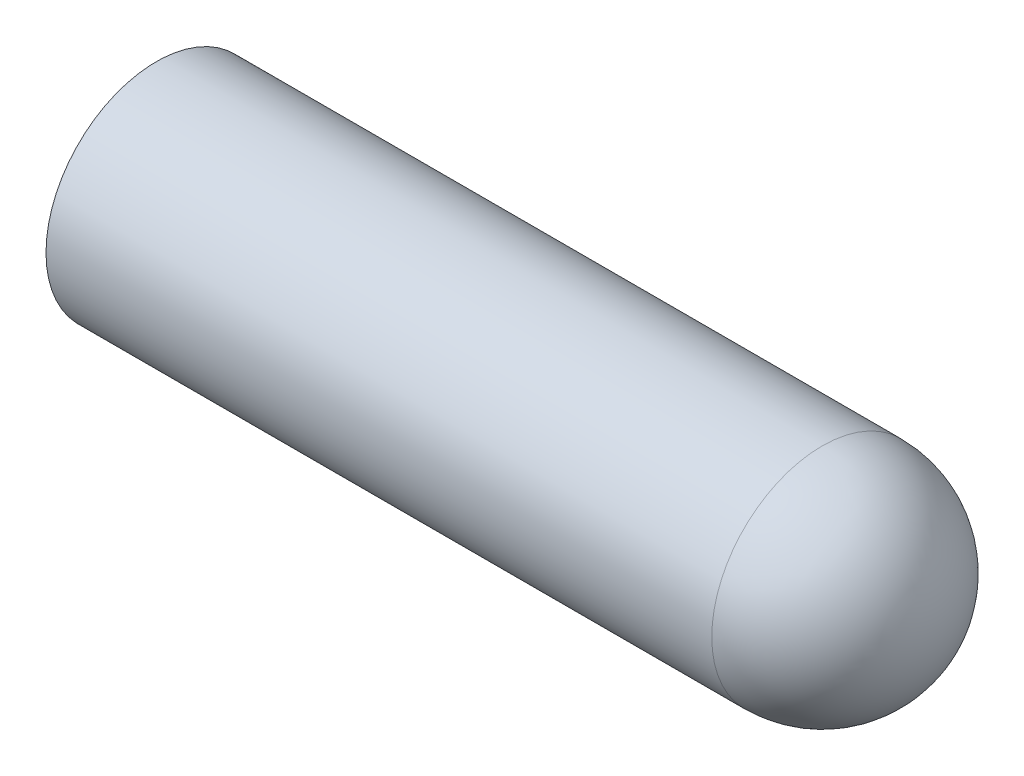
from build123d import *

# Parameters (mm, degrees)
SHELL1_T = -0.8


with BuildPart() as part:
    # Sketch1 → Revolve1 (revolve)
    with BuildSketch(Plane.XY, mode=Mode.PRIVATE) as revolve1_sk:
        with BuildLine():
            Line((-27.25, 7.75), (19.5, 7.75))
            ThreePointArc((19.5, 7.75), (24.980077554, 5.480077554), (27.25, 0))
            Line((27.25, 0), (-27.25, 0))
            Line((-27.25, 0), (-27.25, 7.75))
        make_face()
    revolve(revolve1_sk.sketch.rotate(Axis((-27.25, 0, 0), (1, 0, 0)), 90), axis=Axis((-27.25, 0, 0), (1, 0, 0)))

    # Shell1
    shell1_openings = [part.faces().sort_by_distance(p)[0] for p in [
        (-27.25, 0, 0),
    ]]
    offset(amount=SHELL1_T, openings=shell1_openings, kind=Kind.INTERSECTION)


solid = part.part
